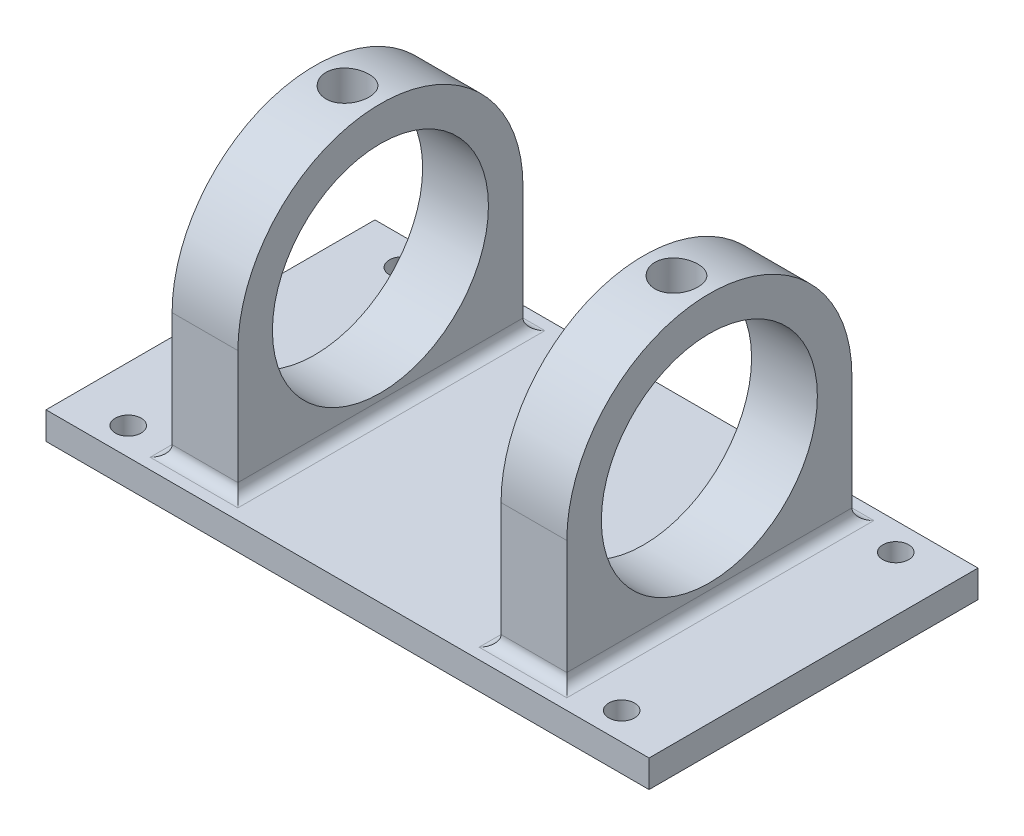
ISO-10303-21;
HEADER;
FILE_DESCRIPTION(('STEP AP214'),'2;1');
FILE_NAME('part.step','',(''),(''),'','','');
FILE_SCHEMA(('AUTOMOTIVE_DESIGN { 1 0 10303 214 1 1 1 1 }'));
ENDSEC;
DATA;
#1=APPLICATION_CONTEXT('core data for automotive mechanical design processes');
#2=APPLICATION_PROTOCOL_DEFINITION('international standard','automotive_design',2000,#1);
#3=PRODUCT_CONTEXT('',#1,'mechanical');
#4=PRODUCT('Part','Part','',(#3));
#5=PRODUCT_RELATED_PRODUCT_CATEGORY('part','',(#4));
#6=PRODUCT_DEFINITION_FORMATION('','',#4);
#7=PRODUCT_DEFINITION_CONTEXT('part definition',#1,'design');
#8=PRODUCT_DEFINITION('design','',#6,#7);
#9=PRODUCT_DEFINITION_SHAPE('','',#8);
#10=(LENGTH_UNIT() NAMED_UNIT(*) SI_UNIT(.MILLI.,.METRE.));
#11=(NAMED_UNIT(*) PLANE_ANGLE_UNIT() SI_UNIT($,.RADIAN.));
#12=(NAMED_UNIT(*) SI_UNIT($,.STERADIAN.) SOLID_ANGLE_UNIT());
#13=UNCERTAINTY_MEASURE_WITH_UNIT(LENGTH_MEASURE(1.E-05),#10,'distance_accuracy_value','');
#14=(GEOMETRIC_REPRESENTATION_CONTEXT(3) GLOBAL_UNCERTAINTY_ASSIGNED_CONTEXT((#13)) GLOBAL_UNIT_ASSIGNED_CONTEXT((#10,
#11,#12)) REPRESENTATION_CONTEXT('',''));
#15=CARTESIAN_POINT('',(0.,0.,0.));
#16=DIRECTION('',(0.,0.,1.));
#17=DIRECTION('',(1.,0.,0.));
#18=AXIS2_PLACEMENT_3D('',#15,#16,#17);
#19=CARTESIAN_POINT('',(15.24,17.68348,0.));
#20=DIRECTION('',(1.,0.,0.));
#21=DIRECTION('',(0.,0.,-1.));
#22=AXIS2_PLACEMENT_3D('',#19,#20,#21);
#23=CYLINDRICAL_SURFACE('',#22,16.51);
#24=CARTESIAN_POINT('',(22.86,17.68348,0.));
#25=DIRECTION('',(1.,0.,0.));
#26=DIRECTION('',(0.,0.,-1.));
#27=AXIS2_PLACEMENT_3D('',#24,#25,#26);
#28=CIRCLE('',#27,16.51);
#29=CARTESIAN_POINT('',(22.86,17.68348,-16.51));
#30=VERTEX_POINT('',#29);
#31=CARTESIAN_POINT('',(22.86,17.68348,16.51));
#32=VERTEX_POINT('',#31);
#33=EDGE_CURVE('E177',#30,#32,#28,.T.);
#34=ORIENTED_EDGE('',*,*,#33,.F.);
#35=DIRECTION('',(1.,0.,0.));
#36=VECTOR('',#35,1.);
#37=CARTESIAN_POINT('',(15.24,17.68348,-16.51));
#38=LINE('',#37,#36);
#39=CARTESIAN_POINT('',(15.24,17.68348,-16.51));
#40=VERTEX_POINT('',#39);
#41=EDGE_CURVE('E164',#40,#30,#38,.T.);
#42=ORIENTED_EDGE('',*,*,#41,.F.);
#43=CARTESIAN_POINT('',(15.24,17.68348,0.));
#44=DIRECTION('',(1.,0.,0.));
#45=DIRECTION('',(0.,0.,-1.));
#46=AXIS2_PLACEMENT_3D('',#43,#44,#45);
#47=CIRCLE('',#46,16.51);
#48=CARTESIAN_POINT('',(15.24,17.68348,16.51));
#49=VERTEX_POINT('',#48);
#50=EDGE_CURVE('E170',#40,#49,#47,.T.);
#51=ORIENTED_EDGE('',*,*,#50,.T.);
#52=DIRECTION('',(1.,0.,0.));
#53=VECTOR('',#52,1.);
#54=CARTESIAN_POINT('',(15.24,17.68348,16.51));
#55=LINE('',#54,#53);
#56=EDGE_CURVE('E179',#49,#32,#55,.T.);
#57=ORIENTED_EDGE('',*,*,#56,.T.);
#58=EDGE_LOOP('',(#34,#42,#51,#57));
#59=FACE_BOUND('',#58,.T.);
#60=CARTESIAN_POINT('',(19.05,34.0046319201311,2.49));
#61=CARTESIAN_POINT('',(18.9109916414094,34.0046342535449,2.48999426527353));
#62=CARTESIAN_POINT('',(18.7719028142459,34.0064270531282,2.47832007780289));
#63=CARTESIAN_POINT('',(18.4976145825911,34.0133996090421,2.43194454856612));
#64=CARTESIAN_POINT('',(18.3624190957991,34.018582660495,2.39722080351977));
#65=CARTESIAN_POINT('',(18.0999274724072,34.031735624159,2.30580920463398));
#66=CARTESIAN_POINT('',(17.9726253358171,34.039703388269,2.24913827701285));
#67=CARTESIAN_POINT('',(17.729354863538,34.0575254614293,2.11548095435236));
#68=CARTESIAN_POINT('',(17.6133849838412,34.0673795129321,2.03849733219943));
#69=CARTESIAN_POINT('',(17.395114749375,34.0879530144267,1.86573461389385));
#70=CARTESIAN_POINT('',(17.2929193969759,34.0986782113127,1.76982352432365));
#71=CARTESIAN_POINT('',(17.1060091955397,34.1197342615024,1.56221345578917));
#72=CARTESIAN_POINT('',(17.0212953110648,34.1300650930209,1.45051360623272));
#73=CARTESIAN_POINT('',(16.8713650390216,34.1492285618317,1.21382374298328));
#74=CARTESIAN_POINT('',(16.8062453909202,34.1580536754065,1.08877178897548));
#75=CARTESIAN_POINT('',(16.6979729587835,34.1731476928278,0.829349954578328));
#76=CARTESIAN_POINT('',(16.6548190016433,34.179416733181,0.694980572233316));
#77=CARTESIAN_POINT('',(16.5920213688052,34.1886517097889,0.42181965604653));
#78=CARTESIAN_POINT('',(16.5722018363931,34.1916423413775,0.283069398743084));
#79=CARTESIAN_POINT('',(16.5560895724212,34.1940681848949,0.00418255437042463));
#80=CARTESIAN_POINT('',(16.5597955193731,34.1935035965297,-0.135953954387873));
#81=CARTESIAN_POINT('',(16.5904903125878,34.1889023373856,-0.412435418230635));
#82=CARTESIAN_POINT('',(16.6172899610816,34.1848938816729,-0.548801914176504));
#83=CARTESIAN_POINT('',(16.6931143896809,34.1738867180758,-0.815079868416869));
#84=CARTESIAN_POINT('',(16.7421397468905,34.1668879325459,-0.944991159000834));
#85=CARTESIAN_POINT('',(16.8612173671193,34.1506380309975,-1.19524318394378));
#86=CARTESIAN_POINT('',(16.9313491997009,34.1413784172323,-1.31554548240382));
#87=CARTESIAN_POINT('',(17.0905908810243,34.1216386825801,-1.54274549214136));
#88=CARTESIAN_POINT('',(17.1797019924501,34.1111584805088,-1.64964231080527));
#89=CARTESIAN_POINT('',(17.3754264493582,34.0900232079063,-1.84811232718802));
#90=CARTESIAN_POINT('',(17.4822049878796,34.0793674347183,-1.9395226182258));
#91=CARTESIAN_POINT('',(17.7096722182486,34.0591835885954,-2.10315246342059));
#92=CARTESIAN_POINT('',(17.8303609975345,34.0496555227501,-2.17537189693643));
#93=CARTESIAN_POINT('',(18.082393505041,34.0328060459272,-2.29859246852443));
#94=CARTESIAN_POINT('',(18.2137456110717,34.0254863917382,-2.34957672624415));
#95=CARTESIAN_POINT('',(18.4832834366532,34.0139134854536,-2.428715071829));
#96=CARTESIAN_POINT('',(18.6214686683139,34.0096600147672,-2.45687078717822));
#97=CARTESIAN_POINT('',(18.8993003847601,34.0047425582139,-2.4893291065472));
#98=CARTESIAN_POINT('',(19.0389192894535,34.0040438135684,-2.49386270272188));
#99=CARTESIAN_POINT('',(19.3169229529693,34.006222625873,-2.47956114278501));
#100=CARTESIAN_POINT('',(19.4553077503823,34.0091000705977,-2.46072671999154));
#101=CARTESIAN_POINT('',(19.7261984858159,34.0180751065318,-2.40041972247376));
#102=CARTESIAN_POINT('',(19.8587306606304,34.0241563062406,-2.35906234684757));
#103=CARTESIAN_POINT('',(20.114981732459,34.0388401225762,-2.25500330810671));
#104=CARTESIAN_POINT('',(20.238700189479,34.0474428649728,-2.19230058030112));
#105=CARTESIAN_POINT('',(20.4748470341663,34.0662822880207,-2.0467762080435));
#106=CARTESIAN_POINT('',(20.5871823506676,34.0765309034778,-1.96380510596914));
#107=CARTESIAN_POINT('',(20.7964171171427,34.0974714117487,-1.78030687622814));
#108=CARTESIAN_POINT('',(20.8933156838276,34.1081633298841,-1.67977874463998));
#109=CARTESIAN_POINT('',(21.069756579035,34.1288944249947,-1.46300251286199));
#110=CARTESIAN_POINT('',(21.1491457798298,34.1389273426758,-1.34662909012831));
#111=CARTESIAN_POINT('',(21.2872472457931,34.1571125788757,-1.1020635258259));
#112=CARTESIAN_POINT('',(21.3459600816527,34.1652649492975,-0.973871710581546));
#113=CARTESIAN_POINT('',(21.4407978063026,34.1787431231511,-0.709785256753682));
#114=CARTESIAN_POINT('',(21.4770062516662,34.1840793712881,-0.573921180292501));
#115=CARTESIAN_POINT('',(21.526077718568,34.1913679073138,-0.29795471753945));
#116=CARTESIAN_POINT('',(21.5389422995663,34.1933204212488,-0.157852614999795));
#117=CARTESIAN_POINT('',(21.5409224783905,34.1936191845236,0.121128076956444));
#118=CARTESIAN_POINT('',(21.5302723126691,34.1920010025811,0.260005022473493));
#119=CARTESIAN_POINT('',(21.486027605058,34.1854119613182,0.533969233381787));
#120=CARTESIAN_POINT('',(21.4524331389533,34.1804411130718,0.66905651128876));
#121=CARTESIAN_POINT('',(21.3633368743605,34.1677027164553,0.931541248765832));
#122=CARTESIAN_POINT('',(21.3078514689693,34.1599372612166,1.05894438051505));
#123=CARTESIAN_POINT('',(21.1765733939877,34.1424623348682,1.30266918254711));
#124=CARTESIAN_POINT('',(21.1007800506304,34.1327527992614,1.41899048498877));
#125=CARTESIAN_POINT('',(20.930191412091,34.1123539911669,1.63843736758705));
#126=CARTESIAN_POINT('',(20.835223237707,34.101656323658,1.7414277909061));
#127=CARTESIAN_POINT('',(20.629344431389,34.0805488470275,1.93009565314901));
#128=CARTESIAN_POINT('',(20.5184300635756,34.0701391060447,2.01576902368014));
#129=CARTESIAN_POINT('',(20.2830655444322,34.0507226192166,2.16780865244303));
#130=CARTESIAN_POINT('',(20.1585420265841,34.041724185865,2.23406238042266));
#131=CARTESIAN_POINT('',(19.9000570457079,34.0262466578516,2.34461534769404));
#132=CARTESIAN_POINT('',(19.7661055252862,34.0197649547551,2.3889373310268));
#133=CARTESIAN_POINT('',(19.5346301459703,34.0115494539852,2.44433017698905));
#134=CARTESIAN_POINT('',(19.4385346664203,34.0089691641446,2.4614300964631));
#135=CARTESIAN_POINT('',(19.2449726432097,34.0055095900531,2.48426694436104));
#136=CARTESIAN_POINT('',(19.1475061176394,34.0046302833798,2.49000402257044));
#137=CARTESIAN_POINT('',(19.05,34.0046319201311,2.49));
#138=B_SPLINE_CURVE_WITH_KNOTS('',3,(#60,#61,#62,#63,#64,#65,#66,#67,#68,#69,#70,#71,#72,#73,
#74,#75,#76,#77,#78,#79,#80,#81,#82,#83,#84,#85,#86,#87,#88,#89,#90,#91,#92,#93,#94,#95,#96,#97,
#98,#99,#100,#101,#102,#103,#104,#105,#106,#107,#108,#109,#110,#111,#112,#113,#114,#115,#116,
#117,#118,#119,#120,#121,#122,#123,#124,#125,#126,#127,#128,#129,#130,#131,#132,#133,#134,#135,
#136,#137),.UNSPECIFIED.,.T.,.F.,(4,2,2,2,2,2,2,2,2,2,2,2,2,2,2,2,2,2,2,2,2,2,2,2,2,2,2,2,2,2,2,
2,2,2,2,2,2,2,4),(0.,0.416668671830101,0.833742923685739,1.2504961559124,1.66719252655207,
2.08690458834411,2.50663980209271,2.92841453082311,3.35016673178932,3.76871968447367,
4.18724912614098,4.60238196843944,5.0175255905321,5.43425430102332,5.85101074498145,
6.27191041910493,6.69281273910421,7.11404900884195,7.5352552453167,7.9523348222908,
8.36940131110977,8.78435437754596,9.19932814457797,9.61745951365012,10.0356147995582,
10.4572935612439,10.8789606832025,11.299052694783,11.7191166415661,12.1350151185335,
12.5509122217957,12.966498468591,13.3820985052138,13.8016278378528,14.2212556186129,
14.6432689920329,15.0648437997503,15.3571160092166,15.6493843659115),.UNSPECIFIED.);
#139=CARTESIAN_POINT('',(19.05,34.0046319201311,2.49));
#140=VERTEX_POINT('',#139);
#141=EDGE_CURVE('E252',#140,#140,#138,.T.);
#142=ORIENTED_EDGE('',*,*,#141,.T.);
#143=EDGE_LOOP('',(#142));
#144=FACE_BOUND('',#143,.T.);
#145=ADVANCED_FACE('F45',(#59,#144),#23,.T.);
#146=CARTESIAN_POINT('',(15.24,17.68348,0.));
#147=DIRECTION('',(1.,0.,0.));
#148=DIRECTION('',(0.,0.,-1.));
#149=AXIS2_PLACEMENT_3D('',#146,#147,#148);
#150=CYLINDRICAL_SURFACE('',#149,12.5095);
#151=CARTESIAN_POINT('',(15.24,17.68348,0.));
#152=DIRECTION('',(1.,0.,0.));
#153=DIRECTION('',(0.,0.,-1.));
#154=AXIS2_PLACEMENT_3D('',#151,#152,#153);
#155=CIRCLE('',#154,12.5095);
#156=CARTESIAN_POINT('',(15.24,17.68348,-12.5095));
#157=VERTEX_POINT('',#156);
#158=EDGE_CURVE('E193',#157,#157,#155,.T.);
#159=ORIENTED_EDGE('',*,*,#158,.F.);
#160=EDGE_LOOP('',(#159));
#161=FACE_BOUND('',#160,.T.);
#162=CARTESIAN_POINT('',(22.86,17.68348,0.));
#163=DIRECTION('',(1.,0.,0.));
#164=DIRECTION('',(0.,0.,-1.));
#165=AXIS2_PLACEMENT_3D('',#162,#163,#164);
#166=CIRCLE('',#165,12.5095);
#167=CARTESIAN_POINT('',(22.86,17.68348,-12.5095));
#168=VERTEX_POINT('',#167);
#169=EDGE_CURVE('E188',#168,#168,#166,.T.);
#170=ORIENTED_EDGE('',*,*,#169,.T.);
#171=EDGE_LOOP('',(#170));
#172=FACE_BOUND('',#171,.T.);
#173=CARTESIAN_POINT('',(19.05,29.9426598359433,2.49));
#174=CARTESIAN_POINT('',(18.9116303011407,29.9426625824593,2.48999486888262));
#175=CARTESIAN_POINT('',(18.7731958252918,29.9450279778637,2.47842699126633));
#176=CARTESIAN_POINT('',(18.5002421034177,29.9542202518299,2.43249911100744));
#177=CARTESIAN_POINT('',(18.3657260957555,29.9610507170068,2.39812078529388));
#178=CARTESIAN_POINT('',(18.1045977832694,29.9783695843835,2.30767944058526));
#179=CARTESIAN_POINT('',(17.9779777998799,29.9888543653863,2.25163788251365));
#180=CARTESIAN_POINT('',(17.7359410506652,30.0122961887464,2.11951948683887));
#181=CARTESIAN_POINT('',(17.620523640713,30.0252530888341,2.04344380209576));
#182=CARTESIAN_POINT('',(17.4025452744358,30.0523820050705,1.87228065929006));
#183=CARTESIAN_POINT('',(17.3001640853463,30.0665672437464,1.77696632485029));
#184=CARTESIAN_POINT('',(17.1127335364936,30.0944381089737,1.57052169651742));
#185=CARTESIAN_POINT('',(17.0276853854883,30.1081237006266,1.45939030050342));
#186=CARTESIAN_POINT('',(16.876638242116,30.1335958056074,1.22327650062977));
#187=CARTESIAN_POINT('',(16.8108099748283,30.1453649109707,1.09818284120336));
#188=CARTESIAN_POINT('',(16.7011727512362,30.1655294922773,0.838437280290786));
#189=CARTESIAN_POINT('',(16.6573617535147,30.1739252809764,0.703786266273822));
#190=CARTESIAN_POINT('',(16.5935620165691,30.1863038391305,0.430613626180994));
#191=CARTESIAN_POINT('',(16.5732697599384,30.1903427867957,0.292165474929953));
#192=CARTESIAN_POINT('',(16.5561366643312,30.1937465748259,0.0137748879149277));
#193=CARTESIAN_POINT('',(16.559293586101,30.193111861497,-0.126167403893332));
#194=CARTESIAN_POINT('',(16.5887388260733,30.1872834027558,-0.401488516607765));
#195=CARTESIAN_POINT('',(16.6147002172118,30.1821540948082,-0.536903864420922));
#196=CARTESIAN_POINT('',(16.6884990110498,30.1679854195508,-0.801416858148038));
#197=CARTESIAN_POINT('',(16.736337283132,30.1589458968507,-0.930514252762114));
#198=CARTESIAN_POINT('',(16.8528354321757,30.137866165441,-1.17966061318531));
#199=CARTESIAN_POINT('',(16.9216235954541,30.1258075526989,-1.2996479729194));
#200=CARTESIAN_POINT('',(17.0779739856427,30.1000192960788,-1.52649781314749));
#201=CARTESIAN_POINT('',(17.1655383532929,30.0862894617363,-1.63335879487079));
#202=CARTESIAN_POINT('',(17.3587496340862,30.0583959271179,-1.83286237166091));
#203=CARTESIAN_POINT('',(17.4646826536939,30.0442288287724,-1.92522761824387));
#204=CARTESIAN_POINT('',(17.6906775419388,30.0172824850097,-2.0909268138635));
#205=CARTESIAN_POINT('',(17.810739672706,30.0045032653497,-2.16426040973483));
#206=CARTESIAN_POINT('',(18.0619805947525,29.9817730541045,-2.28990899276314));
#207=CARTESIAN_POINT('',(18.1931822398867,29.9718280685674,-2.34217944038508));
#208=CARTESIAN_POINT('',(18.4627493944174,29.9559807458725,-2.42385313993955));
#209=CARTESIAN_POINT('',(18.6011139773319,29.9500778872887,-2.45325934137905));
#210=CARTESIAN_POINT('',(18.8785666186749,29.9430875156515,-2.48795604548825));
#211=CARTESIAN_POINT('',(19.0176026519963,29.9419200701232,-2.49364690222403));
#212=CARTESIAN_POINT('',(19.2946374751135,29.9443182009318,-2.48182836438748));
#213=CARTESIAN_POINT('',(19.4326363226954,29.9478835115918,-2.46432027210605));
#214=CARTESIAN_POINT('',(19.7023361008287,29.9592706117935,-2.40694586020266));
#215=CARTESIAN_POINT('',(19.8340843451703,29.9670517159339,-2.36729314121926));
#216=CARTESIAN_POINT('',(20.0890672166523,29.9859580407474,-2.26698332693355));
#217=CARTESIAN_POINT('',(20.212301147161,29.9970835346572,-2.20632451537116));
#218=CARTESIAN_POINT('',(20.4485100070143,30.0216048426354,-2.06481694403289));
#219=CARTESIAN_POINT('',(20.5613318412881,30.0350281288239,-1.98371748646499));
#220=CARTESIAN_POINT('',(20.7719110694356,30.06255702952,-1.80396521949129));
#221=CARTESIAN_POINT('',(20.8696669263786,30.0766627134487,-1.70531062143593));
#222=CARTESIAN_POINT('',(21.0488554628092,30.1042262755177,-1.4914519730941));
#223=CARTESIAN_POINT('',(21.1300175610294,30.1176710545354,-1.37601924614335));
#224=CARTESIAN_POINT('',(21.2717962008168,30.1421707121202,-1.13292442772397));
#225=CARTESIAN_POINT('',(21.3324135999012,30.1532256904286,-1.00526284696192));
#226=CARTESIAN_POINT('',(21.4309869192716,30.1716441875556,-0.742048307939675));
#227=CARTESIAN_POINT('',(21.4690705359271,30.1790284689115,-0.606544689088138));
#228=CARTESIAN_POINT('',(21.5219000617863,30.1893625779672,-0.330902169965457));
#229=CARTESIAN_POINT('',(21.5366487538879,30.1923129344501,-0.190763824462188));
#230=CARTESIAN_POINT('',(21.5422828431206,30.1934344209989,0.08758481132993));
#231=CARTESIAN_POINT('',(21.5335751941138,30.1916870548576,0.225786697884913));
#232=CARTESIAN_POINT('',(21.493441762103,30.1837806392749,0.498715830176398));
#233=CARTESIAN_POINT('',(21.4620162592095,30.177621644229,0.633443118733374));
#234=CARTESIAN_POINT('',(21.3775193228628,30.1615861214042,0.895348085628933));
#235=CARTESIAN_POINT('',(21.3244963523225,30.1517179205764,1.02254194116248));
#236=CARTESIAN_POINT('',(21.1983608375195,30.129326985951,1.26628620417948));
#237=CARTESIAN_POINT('',(21.1252467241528,30.1168040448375,1.3828357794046));
#238=CARTESIAN_POINT('',(20.9596294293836,30.0902283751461,1.60399646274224));
#239=CARTESIAN_POINT('',(20.866834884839,30.0761543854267,1.70838685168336));
#240=CARTESIAN_POINT('',(20.6650899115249,30.048189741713,1.9002544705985));
#241=CARTESIAN_POINT('',(20.5561356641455,30.0342991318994,1.98772769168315));
#242=CARTESIAN_POINT('',(20.3237723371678,30.0081111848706,2.14416216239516));
#243=CARTESIAN_POINT('',(20.2002216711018,29.9958323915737,2.21291633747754));
#244=CARTESIAN_POINT('',(19.9431120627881,29.9744845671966,2.3285798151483));
#245=CARTESIAN_POINT('',(19.8095623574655,29.9654126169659,2.37550899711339));
#246=CARTESIAN_POINT('',(19.5714193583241,29.9533228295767,2.4370560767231));
#247=CARTESIAN_POINT('',(19.4681871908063,29.9493489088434,2.45687463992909));
#248=CARTESIAN_POINT('',(19.2599824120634,29.9440164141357,2.48334832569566));
#249=CARTESIAN_POINT('',(19.1550098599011,29.9426577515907,2.49000389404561));
#250=CARTESIAN_POINT('',(19.05,29.9426598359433,2.49));
#251=B_SPLINE_CURVE_WITH_KNOTS('',3,(#173,#174,#175,#176,#177,#178,#179,#180,#181,#182,#183,
#184,#185,#186,#187,#188,#189,#190,#191,#192,#193,#194,#195,#196,#197,#198,#199,#200,#201,#202,
#203,#204,#205,#206,#207,#208,#209,#210,#211,#212,#213,#214,#215,#216,#217,#218,#219,#220,#221,
#222,#223,#224,#225,#226,#227,#228,#229,#230,#231,#232,#233,#234,#235,#236,#237,#238,#239,#240,
#241,#242,#243,#244,#245,#246,#247,#248,#249,#250),.UNSPECIFIED.,.T.,.F.,(4,2,2,2,2,2,2,2,2,2,2,
2,2,2,2,2,2,2,2,2,2,2,2,2,2,2,2,2,2,2,2,2,2,2,2,2,2,2,4),(0.,0.414724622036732,
0.829782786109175,1.24443081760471,1.65905499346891,2.0788890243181,2.49875232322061,
2.92223897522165,3.3456863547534,3.76360591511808,4.18148556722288,4.59347047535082,
5.00547175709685,5.42004845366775,5.83467244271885,6.25645525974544,6.67824590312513,
7.10092383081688,7.52354722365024,7.93900639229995,8.35444223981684,8.76593845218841,
9.17746829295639,9.59431441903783,10.0112030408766,10.43442585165,10.8576309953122,
11.278414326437,11.6991474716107,12.1126283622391,12.5261041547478,12.9386572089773,
13.3512424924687,13.7704256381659,14.1897079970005,14.6134557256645,15.0368167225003,
15.351565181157,15.6663029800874),.UNSPECIFIED.);
#252=CARTESIAN_POINT('',(19.05,29.9426598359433,2.49));
#253=VERTEX_POINT('',#252);
#254=EDGE_CURVE('E49',#253,#253,#251,.T.);
#255=ORIENTED_EDGE('',*,*,#254,.F.);
#256=EDGE_LOOP('',(#255));
#257=FACE_BOUND('',#256,.T.);
#258=ADVANCED_FACE('F283',(#161,#172,#257),#150,.F.);
#259=CARTESIAN_POINT('',(0.,3.175,0.));
#260=DIRECTION('',(0.,-1.,0.));
#261=DIRECTION('',(0.,0.,-1.));
#262=AXIS2_PLACEMENT_3D('',#259,#260,#261);
#263=PLANE('',#262);
#264=CARTESIAN_POINT('',(28.575,3.175,-15.875));
#265=DIRECTION('',(0.,1.,0.));
#266=DIRECTION('',(0.,0.,1.));
#267=AXIS2_PLACEMENT_3D('',#264,#265,#266);
#268=CIRCLE('',#267,1.49999999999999);
#269=CARTESIAN_POINT('',(28.575,3.175,-14.375));
#270=VERTEX_POINT('',#269);
#271=EDGE_CURVE('E705',#270,#270,#268,.T.);
#272=ORIENTED_EDGE('',*,*,#271,.F.);
#273=EDGE_LOOP('',(#272));
#274=FACE_BOUND('',#273,.T.);
#275=CARTESIAN_POINT('',(-28.575,3.175,15.875));
#276=DIRECTION('',(0.,1.,0.));
#277=DIRECTION('',(0.,0.,1.));
#278=AXIS2_PLACEMENT_3D('',#275,#276,#277);
#279=CIRCLE('',#278,1.49999999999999);
#280=CARTESIAN_POINT('',(-28.575,3.175,17.375));
#281=VERTEX_POINT('',#280);
#282=EDGE_CURVE('E709',#281,#281,#279,.T.);
#283=ORIENTED_EDGE('',*,*,#282,.F.);
#284=EDGE_LOOP('',(#283));
#285=FACE_BOUND('',#284,.T.);
#286=CARTESIAN_POINT('',(-28.575,3.175,-15.875));
#287=DIRECTION('',(0.,1.,0.));
#288=DIRECTION('',(0.,0.,1.));
#289=AXIS2_PLACEMENT_3D('',#286,#287,#288);
#290=CIRCLE('',#289,1.49999999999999);
#291=CARTESIAN_POINT('',(-28.575,3.175,-14.375));
#292=VERTEX_POINT('',#291);
#293=EDGE_CURVE('E713',#292,#292,#290,.T.);
#294=ORIENTED_EDGE('',*,*,#293,.F.);
#295=EDGE_LOOP('',(#294));
#296=FACE_BOUND('',#295,.T.);
#297=CARTESIAN_POINT('',(28.575,3.175,15.875));
#298=DIRECTION('',(0.,1.,0.));
#299=DIRECTION('',(0.,0.,1.));
#300=AXIS2_PLACEMENT_3D('',#297,#298,#299);
#301=CIRCLE('',#300,1.49999999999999);
#302=CARTESIAN_POINT('',(28.575,3.175,17.375));
#303=VERTEX_POINT('',#302);
#304=EDGE_CURVE('E716',#303,#303,#301,.T.);
#305=ORIENTED_EDGE('',*,*,#304,.F.);
#306=EDGE_LOOP('',(#305));
#307=FACE_BOUND('',#306,.T.);
#308=DIRECTION('',(0.,0.,-1.));
#309=VECTOR('',#308,1.);
#310=CARTESIAN_POINT('',(24.13,3.175,16.51));
#311=LINE('',#310,#309);
#312=CARTESIAN_POINT('',(24.13,3.175,-17.78));
#313=VERTEX_POINT('',#312);
#314=CARTESIAN_POINT('',(24.13,3.175,17.78));
#315=VERTEX_POINT('',#314);
#316=EDGE_CURVE('E236',#313,#315,#311,.F.);
#317=ORIENTED_EDGE('',*,*,#316,.T.);
#318=DIRECTION('',(1.,0.,0.));
#319=VECTOR('',#318,1.);
#320=CARTESIAN_POINT('',(0.,3.175,17.78));
#321=LINE('',#320,#319);
#322=CARTESIAN_POINT('',(13.97,3.175,17.78));
#323=VERTEX_POINT('',#322);
#324=EDGE_CURVE('E243',#315,#323,#321,.F.);
#325=ORIENTED_EDGE('',*,*,#324,.T.);
#326=DIRECTION('',(0.,0.,-1.));
#327=VECTOR('',#326,1.);
#328=CARTESIAN_POINT('',(13.97,3.175,0.));
#329=LINE('',#328,#327);
#330=CARTESIAN_POINT('',(13.97,3.175,-17.78));
#331=VERTEX_POINT('',#330);
#332=EDGE_CURVE('E241',#323,#331,#329,.T.);
#333=ORIENTED_EDGE('',*,*,#332,.T.);
#334=DIRECTION('',(1.,0.,0.));
#335=VECTOR('',#334,1.);
#336=CARTESIAN_POINT('',(0.,3.175,-17.78));
#337=LINE('',#336,#335);
#338=EDGE_CURVE('E239',#331,#313,#337,.T.);
#339=ORIENTED_EDGE('',*,*,#338,.T.);
#340=EDGE_LOOP('',(#317,#325,#333,#339));
#341=FACE_BOUND('',#340,.T.);
#342=DIRECTION('',(0.,0.,-1.));
#343=VECTOR('',#342,1.);
#344=CARTESIAN_POINT('',(-13.97,3.175,0.));
#345=LINE('',#344,#343);
#346=CARTESIAN_POINT('',(-13.97,3.175,-17.78));
#347=VERTEX_POINT('',#346);
#348=CARTESIAN_POINT('',(-13.97,3.175,17.78));
#349=VERTEX_POINT('',#348);
#350=EDGE_CURVE('E609',#347,#349,#345,.F.);
#351=ORIENTED_EDGE('',*,*,#350,.T.);
#352=DIRECTION('',(-1.,0.,0.));
#353=VECTOR('',#352,1.);
#354=CARTESIAN_POINT('',(-22.86,3.175,17.78));
#355=LINE('',#354,#353);
#356=CARTESIAN_POINT('',(-24.13,3.175,17.78));
#357=VERTEX_POINT('',#356);
#358=EDGE_CURVE('E611',#349,#357,#355,.T.);
#359=ORIENTED_EDGE('',*,*,#358,.T.);
#360=DIRECTION('',(0.,0.,-1.));
#361=VECTOR('',#360,1.);
#362=CARTESIAN_POINT('',(-24.13,3.175,-16.51));
#363=LINE('',#362,#361);
#364=CARTESIAN_POINT('',(-24.13,3.175,-17.78));
#365=VERTEX_POINT('',#364);
#366=EDGE_CURVE('E605',#357,#365,#363,.T.);
#367=ORIENTED_EDGE('',*,*,#366,.T.);
#368=DIRECTION('',(-1.,0.,0.));
#369=VECTOR('',#368,1.);
#370=CARTESIAN_POINT('',(-15.24,3.175,-17.78));
#371=LINE('',#370,#369);
#372=EDGE_CURVE('E607',#365,#347,#371,.F.);
#373=ORIENTED_EDGE('',*,*,#372,.T.);
#374=EDGE_LOOP('',(#351,#359,#367,#373));
#375=FACE_BOUND('',#374,.T.);
#376=DIRECTION('',(0.,0.,-1.));
#377=VECTOR('',#376,1.);
#378=CARTESIAN_POINT('',(34.925,3.175,19.05));
#379=LINE('',#378,#377);
#380=CARTESIAN_POINT('',(34.925,3.175,19.05));
#381=VERTEX_POINT('',#380);
#382=CARTESIAN_POINT('',(34.925,3.175,-19.05));
#383=VERTEX_POINT('',#382);
#384=EDGE_CURVE('E596',#381,#383,#379,.T.);
#385=ORIENTED_EDGE('',*,*,#384,.T.);
#386=DIRECTION('',(-1.,0.,0.));
#387=VECTOR('',#386,1.);
#388=CARTESIAN_POINT('',(-34.925,3.175,-19.05));
#389=LINE('',#388,#387);
#390=CARTESIAN_POINT('',(-34.925,3.175,-19.05));
#391=VERTEX_POINT('',#390);
#392=EDGE_CURVE('E659',#383,#391,#389,.T.);
#393=ORIENTED_EDGE('',*,*,#392,.T.);
#394=DIRECTION('',(0.,0.,1.));
#395=VECTOR('',#394,1.);
#396=CARTESIAN_POINT('',(-34.925,3.175,19.05));
#397=LINE('',#396,#395);
#398=CARTESIAN_POINT('',(-34.925,3.175,19.05));
#399=VERTEX_POINT('',#398);
#400=EDGE_CURVE('E660',#391,#399,#397,.T.);
#401=ORIENTED_EDGE('',*,*,#400,.T.);
#402=DIRECTION('',(1.,0.,0.));
#403=VECTOR('',#402,1.);
#404=CARTESIAN_POINT('',(-34.925,3.175,19.05));
#405=LINE('',#404,#403);
#406=EDGE_CURVE('E590',#399,#381,#405,.T.);
#407=ORIENTED_EDGE('',*,*,#406,.T.);
#408=EDGE_LOOP('',(#385,#393,#401,#407));
#409=FACE_BOUND('',#408,.T.);
#410=ADVANCED_FACE('F288',(#274,#285,#296,#307,#341,#375,#409),#263,.F.);
#411=CARTESIAN_POINT('',(34.925,3.175,19.05));
#412=DIRECTION('',(-1.,0.,0.));
#413=DIRECTION('',(0.,0.,1.));
#414=AXIS2_PLACEMENT_3D('',#411,#412,#413);
#415=PLANE('',#414);
#416=DIRECTION('',(0.,0.,-1.));
#417=VECTOR('',#416,1.);
#418=CARTESIAN_POINT('',(34.925,0.,19.05));
#419=LINE('',#418,#417);
#420=CARTESIAN_POINT('',(34.925,0.,19.05));
#421=VERTEX_POINT('',#420);
#422=CARTESIAN_POINT('',(34.925,0.,-19.05));
#423=VERTEX_POINT('',#422);
#424=EDGE_CURVE('E573',#421,#423,#419,.T.);
#425=ORIENTED_EDGE('',*,*,#424,.T.);
#426=DIRECTION('',(0.,-1.,0.));
#427=VECTOR('',#426,1.);
#428=CARTESIAN_POINT('',(34.925,3.175,-19.05));
#429=LINE('',#428,#427);
#430=EDGE_CURVE('E576',#383,#423,#429,.T.);
#431=ORIENTED_EDGE('',*,*,#430,.F.);
#432=ORIENTED_EDGE('',*,*,#384,.F.);
#433=DIRECTION('',(0.,-1.,0.));
#434=VECTOR('',#433,1.);
#435=CARTESIAN_POINT('',(34.925,3.175,19.05));
#436=LINE('',#435,#434);
#437=EDGE_CURVE('E578',#381,#421,#436,.T.);
#438=ORIENTED_EDGE('',*,*,#437,.T.);
#439=EDGE_LOOP('',(#425,#431,#432,#438));
#440=FACE_BOUND('',#439,.T.);
#441=ADVANCED_FACE('F382',(#440),#415,.F.);
#442=CARTESIAN_POINT('',(-34.925,3.175,-19.05));
#443=DIRECTION('',(0.,0.,1.));
#444=DIRECTION('',(1.,0.,0.));
#445=AXIS2_PLACEMENT_3D('',#442,#443,#444);
#446=PLANE('',#445);
#447=DIRECTION('',(-1.,0.,0.));
#448=VECTOR('',#447,1.);
#449=CARTESIAN_POINT('',(-34.925,0.,-19.05));
#450=LINE('',#449,#448);
#451=CARTESIAN_POINT('',(-34.925,0.,-19.05));
#452=VERTEX_POINT('',#451);
#453=EDGE_CURVE('E581',#423,#452,#450,.T.);
#454=ORIENTED_EDGE('',*,*,#453,.T.);
#455=DIRECTION('',(0.,-1.,0.));
#456=VECTOR('',#455,1.);
#457=CARTESIAN_POINT('',(-34.925,3.175,-19.05));
#458=LINE('',#457,#456);
#459=EDGE_CURVE('E601',#391,#452,#458,.T.);
#460=ORIENTED_EDGE('',*,*,#459,.F.);
#461=ORIENTED_EDGE('',*,*,#392,.F.);
#462=ORIENTED_EDGE('',*,*,#430,.T.);
#463=EDGE_LOOP('',(#454,#460,#461,#462));
#464=FACE_BOUND('',#463,.T.);
#465=ADVANCED_FACE('F543',(#464),#446,.F.);
#466=CARTESIAN_POINT('',(-34.925,3.175,19.05));
#467=DIRECTION('',(1.,0.,0.));
#468=DIRECTION('',(0.,0.,-1.));
#469=AXIS2_PLACEMENT_3D('',#466,#467,#468);
#470=PLANE('',#469);
#471=DIRECTION('',(0.,0.,1.));
#472=VECTOR('',#471,1.);
#473=CARTESIAN_POINT('',(-34.925,0.,19.05));
#474=LINE('',#473,#472);
#475=CARTESIAN_POINT('',(-34.925,0.,19.05));
#476=VERTEX_POINT('',#475);
#477=EDGE_CURVE('E584',#452,#476,#474,.T.);
#478=ORIENTED_EDGE('',*,*,#477,.T.);
#479=DIRECTION('',(0.,-1.,0.));
#480=VECTOR('',#479,1.);
#481=CARTESIAN_POINT('',(-34.925,3.175,19.05));
#482=LINE('',#481,#480);
#483=EDGE_CURVE('E598',#399,#476,#482,.T.);
#484=ORIENTED_EDGE('',*,*,#483,.F.);
#485=ORIENTED_EDGE('',*,*,#400,.F.);
#486=ORIENTED_EDGE('',*,*,#459,.T.);
#487=EDGE_LOOP('',(#478,#484,#485,#486));
#488=FACE_BOUND('',#487,.T.);
#489=ADVANCED_FACE('F534',(#488),#470,.F.);
#490=CARTESIAN_POINT('',(-34.925,3.175,19.05));
#491=DIRECTION('',(0.,0.,-1.));
#492=DIRECTION('',(-1.,0.,0.));
#493=AXIS2_PLACEMENT_3D('',#490,#491,#492);
#494=PLANE('',#493);
#495=DIRECTION('',(1.,0.,0.));
#496=VECTOR('',#495,1.);
#497=CARTESIAN_POINT('',(-34.925,0.,19.05));
#498=LINE('',#497,#496);
#499=EDGE_CURVE('E594',#476,#421,#498,.T.);
#500=ORIENTED_EDGE('',*,*,#499,.T.);
#501=ORIENTED_EDGE('',*,*,#437,.F.);
#502=ORIENTED_EDGE('',*,*,#406,.F.);
#503=ORIENTED_EDGE('',*,*,#483,.T.);
#504=EDGE_LOOP('',(#500,#501,#502,#503));
#505=FACE_BOUND('',#504,.T.);
#506=ADVANCED_FACE('F371',(#505),#494,.F.);
#507=CARTESIAN_POINT('',(0.,0.,0.));
#508=DIRECTION('',(0.,-1.,0.));
#509=DIRECTION('',(0.,0.,-1.));
#510=AXIS2_PLACEMENT_3D('',#507,#508,#509);
#511=PLANE('',#510);
#512=CARTESIAN_POINT('',(28.575,0.,-15.875));
#513=DIRECTION('',(0.,1.,0.));
#514=DIRECTION('',(0.,0.,1.));
#515=AXIS2_PLACEMENT_3D('',#512,#513,#514);
#516=CIRCLE('',#515,1.5);
#517=CARTESIAN_POINT('',(28.575,0.,-14.375));
#518=VERTEX_POINT('',#517);
#519=EDGE_CURVE('E728',#518,#518,#516,.T.);
#520=ORIENTED_EDGE('',*,*,#519,.T.);
#521=EDGE_LOOP('',(#520));
#522=FACE_BOUND('',#521,.T.);
#523=CARTESIAN_POINT('',(-28.575,0.,15.875));
#524=DIRECTION('',(0.,1.,0.));
#525=DIRECTION('',(0.,0.,1.));
#526=AXIS2_PLACEMENT_3D('',#523,#524,#525);
#527=CIRCLE('',#526,1.5);
#528=CARTESIAN_POINT('',(-28.575,0.,17.375));
#529=VERTEX_POINT('',#528);
#530=EDGE_CURVE('E724',#529,#529,#527,.T.);
#531=ORIENTED_EDGE('',*,*,#530,.T.);
#532=EDGE_LOOP('',(#531));
#533=FACE_BOUND('',#532,.T.);
#534=CARTESIAN_POINT('',(-28.575,0.,-15.875));
#535=DIRECTION('',(0.,1.,0.));
#536=DIRECTION('',(0.,0.,1.));
#537=AXIS2_PLACEMENT_3D('',#534,#535,#536);
#538=CIRCLE('',#537,1.5);
#539=CARTESIAN_POINT('',(-28.575,0.,-14.375));
#540=VERTEX_POINT('',#539);
#541=EDGE_CURVE('E718',#540,#540,#538,.T.);
#542=ORIENTED_EDGE('',*,*,#541,.T.);
#543=EDGE_LOOP('',(#542));
#544=FACE_BOUND('',#543,.T.);
#545=CARTESIAN_POINT('',(28.575,0.,15.875));
#546=DIRECTION('',(0.,1.,0.));
#547=DIRECTION('',(0.,0.,1.));
#548=AXIS2_PLACEMENT_3D('',#545,#546,#547);
#549=CIRCLE('',#548,1.5);
#550=CARTESIAN_POINT('',(28.575,0.,17.375));
#551=VERTEX_POINT('',#550);
#552=EDGE_CURVE('E273',#551,#551,#549,.T.);
#553=ORIENTED_EDGE('',*,*,#552,.T.);
#554=EDGE_LOOP('',(#553));
#555=FACE_BOUND('',#554,.T.);
#556=ORIENTED_EDGE('',*,*,#424,.F.);
#557=ORIENTED_EDGE('',*,*,#499,.F.);
#558=ORIENTED_EDGE('',*,*,#477,.F.);
#559=ORIENTED_EDGE('',*,*,#453,.F.);
#560=EDGE_LOOP('',(#556,#557,#558,#559));
#561=FACE_BOUND('',#560,.T.);
#562=ADVANCED_FACE('F365',(#522,#533,#544,#555,#561),#511,.T.);
#563=CARTESIAN_POINT('',(-15.24,17.68348,0.));
#564=DIRECTION('',(1.,0.,0.));
#565=DIRECTION('',(0.,0.,-1.));
#566=AXIS2_PLACEMENT_3D('',#563,#564,#565);
#567=PLANE('',#566);
#568=DIRECTION('',(0.,-1.,0.));
#569=VECTOR('',#568,1.);
#570=CARTESIAN_POINT('',(-15.24,17.68348,16.51));
#571=LINE('',#570,#569);
#572=CARTESIAN_POINT('',(-15.24,17.68348,16.51));
#573=VERTEX_POINT('',#572);
#574=CARTESIAN_POINT('',(-15.24,4.445,16.51));
#575=VERTEX_POINT('',#574);
#576=EDGE_CURVE('E643',#573,#575,#571,.T.);
#577=ORIENTED_EDGE('',*,*,#576,.T.);
#578=DIRECTION('',(0.,0.,-1.));
#579=VECTOR('',#578,1.);
#580=CARTESIAN_POINT('',(-15.24,4.445,0.));
#581=LINE('',#580,#579);
#582=CARTESIAN_POINT('',(-15.24,4.445,-16.51));
#583=VERTEX_POINT('',#582);
#584=EDGE_CURVE('E617',#575,#583,#581,.T.);
#585=ORIENTED_EDGE('',*,*,#584,.T.);
#586=DIRECTION('',(0.,1.,0.));
#587=VECTOR('',#586,1.);
#588=CARTESIAN_POINT('',(-15.24,17.68348,-16.51));
#589=LINE('',#588,#587);
#590=CARTESIAN_POINT('',(-15.24,17.68348,-16.51));
#591=VERTEX_POINT('',#590);
#592=EDGE_CURVE('E647',#583,#591,#589,.T.);
#593=ORIENTED_EDGE('',*,*,#592,.T.);
#594=CARTESIAN_POINT('',(-15.24,17.68348,0.));
#595=DIRECTION('',(1.,0.,0.));
#596=DIRECTION('',(0.,0.,-1.));
#597=AXIS2_PLACEMENT_3D('',#594,#595,#596);
#598=CIRCLE('',#597,16.51);
#599=EDGE_CURVE('E640',#591,#573,#598,.T.);
#600=ORIENTED_EDGE('',*,*,#599,.T.);
#601=EDGE_LOOP('',(#577,#585,#593,#600));
#602=FACE_BOUND('',#601,.T.);
#603=CARTESIAN_POINT('',(-15.24,17.68348,0.));
#604=DIRECTION('',(1.,0.,0.));
#605=DIRECTION('',(0.,0.,-1.));
#606=AXIS2_PLACEMENT_3D('',#603,#604,#605);
#607=CIRCLE('',#606,12.5095);
#608=CARTESIAN_POINT('',(-15.24,17.68348,-12.5095));
#609=VERTEX_POINT('',#608);
#610=EDGE_CURVE('E205',#609,#609,#607,.T.);
#611=ORIENTED_EDGE('',*,*,#610,.F.);
#612=EDGE_LOOP('',(#611));
#613=FACE_BOUND('',#612,.T.);
#614=ADVANCED_FACE('F370',(#602,#613),#567,.T.);
#615=CARTESIAN_POINT('',(-22.86,17.68348,0.));
#616=DIRECTION('',(1.,0.,0.));
#617=DIRECTION('',(0.,0.,-1.));
#618=AXIS2_PLACEMENT_3D('',#615,#616,#617);
#619=PLANE('',#618);
#620=DIRECTION('',(0.,1.,0.));
#621=VECTOR('',#620,1.);
#622=CARTESIAN_POINT('',(-22.86,17.68348,-16.51));
#623=LINE('',#622,#621);
#624=CARTESIAN_POINT('',(-22.86,4.445,-16.51));
#625=VERTEX_POINT('',#624);
#626=CARTESIAN_POINT('',(-22.86,17.68348,-16.51));
#627=VERTEX_POINT('',#626);
#628=EDGE_CURVE('E644',#625,#627,#623,.T.);
#629=ORIENTED_EDGE('',*,*,#628,.F.);
#630=DIRECTION('',(0.,0.,-1.));
#631=VECTOR('',#630,1.);
#632=CARTESIAN_POINT('',(-22.86,4.445,16.51));
#633=LINE('',#632,#631);
#634=CARTESIAN_POINT('',(-22.86,4.445,16.51));
#635=VERTEX_POINT('',#634);
#636=EDGE_CURVE('E237',#625,#635,#633,.F.);
#637=ORIENTED_EDGE('',*,*,#636,.T.);
#638=DIRECTION('',(0.,-1.,0.));
#639=VECTOR('',#638,1.);
#640=CARTESIAN_POINT('',(-22.86,17.68348,16.51));
#641=LINE('',#640,#639);
#642=CARTESIAN_POINT('',(-22.86,17.68348,16.51));
#643=VERTEX_POINT('',#642);
#644=EDGE_CURVE('E651',#643,#635,#641,.T.);
#645=ORIENTED_EDGE('',*,*,#644,.F.);
#646=CARTESIAN_POINT('',(-22.86,17.68348,0.));
#647=DIRECTION('',(1.,0.,0.));
#648=DIRECTION('',(0.,0.,-1.));
#649=AXIS2_PLACEMENT_3D('',#646,#647,#648);
#650=CIRCLE('',#649,16.51);
#651=EDGE_CURVE('E638',#627,#643,#650,.T.);
#652=ORIENTED_EDGE('',*,*,#651,.F.);
#653=EDGE_LOOP('',(#629,#637,#645,#652));
#654=FACE_BOUND('',#653,.T.);
#655=CARTESIAN_POINT('',(-22.86,17.68348,0.));
#656=DIRECTION('',(1.,0.,0.));
#657=DIRECTION('',(0.,0.,-1.));
#658=AXIS2_PLACEMENT_3D('',#655,#656,#657);
#659=CIRCLE('',#658,12.5095);
#660=CARTESIAN_POINT('',(-22.86,17.68348,-12.5095));
#661=VERTEX_POINT('',#660);
#662=EDGE_CURVE('E630',#661,#661,#659,.T.);
#663=ORIENTED_EDGE('',*,*,#662,.T.);
#664=EDGE_LOOP('',(#663));
#665=FACE_BOUND('',#664,.T.);
#666=ADVANCED_FACE('F511',(#654,#665),#619,.F.);
#667=CARTESIAN_POINT('',(-15.24,17.68348,0.));
#668=DIRECTION('',(-1.,0.,0.));
#669=DIRECTION('',(0.,0.,1.));
#670=AXIS2_PLACEMENT_3D('',#667,#668,#669);
#671=CYLINDRICAL_SURFACE('',#670,16.51);
#672=CARTESIAN_POINT('',(-19.05,34.0046319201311,2.49));
#673=CARTESIAN_POINT('',(-19.1890083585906,34.0046342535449,2.48999426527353));
#674=CARTESIAN_POINT('',(-19.3280971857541,34.0064270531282,2.47832007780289));
#675=CARTESIAN_POINT('',(-19.6023854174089,34.0133996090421,2.43194454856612));
#676=CARTESIAN_POINT('',(-19.7375809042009,34.018582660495,2.39722080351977));
#677=CARTESIAN_POINT('',(-20.0000725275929,34.031735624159,2.30580920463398));
#678=CARTESIAN_POINT('',(-20.1273746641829,34.039703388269,2.24913827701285));
#679=CARTESIAN_POINT('',(-20.370645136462,34.0575254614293,2.11548095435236));
#680=CARTESIAN_POINT('',(-20.4866150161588,34.0673795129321,2.03849733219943));
#681=CARTESIAN_POINT('',(-20.704885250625,34.0879530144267,1.86573461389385));
#682=CARTESIAN_POINT('',(-20.8070806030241,34.0986782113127,1.76982352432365));
#683=CARTESIAN_POINT('',(-20.9939908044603,34.1197342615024,1.56221345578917));
#684=CARTESIAN_POINT('',(-21.0787046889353,34.1300650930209,1.45051360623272));
#685=CARTESIAN_POINT('',(-21.2286349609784,34.1492285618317,1.21382374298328));
#686=CARTESIAN_POINT('',(-21.2937546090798,34.1580536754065,1.08877178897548));
#687=CARTESIAN_POINT('',(-21.4020270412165,34.1731476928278,0.829349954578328));
#688=CARTESIAN_POINT('',(-21.4451809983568,34.179416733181,0.694980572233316));
#689=CARTESIAN_POINT('',(-21.5079786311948,34.1886517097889,0.421819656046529));
#690=CARTESIAN_POINT('',(-21.5277981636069,34.1916423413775,0.283069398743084));
#691=CARTESIAN_POINT('',(-21.5439104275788,34.1940681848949,0.00418255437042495));
#692=CARTESIAN_POINT('',(-21.5402044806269,34.1935035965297,-0.135953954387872));
#693=CARTESIAN_POINT('',(-21.5095096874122,34.1889023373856,-0.412435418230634));
#694=CARTESIAN_POINT('',(-21.4827100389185,34.1848938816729,-0.548801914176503));
#695=CARTESIAN_POINT('',(-21.4068856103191,34.1738867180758,-0.815079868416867));
#696=CARTESIAN_POINT('',(-21.3578602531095,34.1668879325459,-0.944991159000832));
#697=CARTESIAN_POINT('',(-21.2387826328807,34.1506380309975,-1.19524318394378));
#698=CARTESIAN_POINT('',(-21.1686508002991,34.1413784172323,-1.31554548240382));
#699=CARTESIAN_POINT('',(-21.0094091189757,34.1216386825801,-1.54274549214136));
#700=CARTESIAN_POINT('',(-20.9202980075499,34.1111584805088,-1.64964231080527));
#701=CARTESIAN_POINT('',(-20.7245735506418,34.0900232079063,-1.84811232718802));
#702=CARTESIAN_POINT('',(-20.6177950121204,34.0793674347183,-1.9395226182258));
#703=CARTESIAN_POINT('',(-20.3903277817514,34.0591835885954,-2.10315246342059));
#704=CARTESIAN_POINT('',(-20.2696390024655,34.0496555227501,-2.17537189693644));
#705=CARTESIAN_POINT('',(-20.017606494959,34.0328060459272,-2.29859246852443));
#706=CARTESIAN_POINT('',(-19.8862543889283,34.0254863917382,-2.34957672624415));
#707=CARTESIAN_POINT('',(-19.6167165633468,34.0139134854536,-2.428715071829));
#708=CARTESIAN_POINT('',(-19.4785313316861,34.0096600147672,-2.45687078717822));
#709=CARTESIAN_POINT('',(-19.2006996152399,34.0047425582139,-2.4893291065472));
#710=CARTESIAN_POINT('',(-19.0610807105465,34.0040438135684,-2.49386270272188));
#711=CARTESIAN_POINT('',(-18.7830770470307,34.006222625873,-2.47956114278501));
#712=CARTESIAN_POINT('',(-18.6446922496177,34.0091000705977,-2.46072671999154));
#713=CARTESIAN_POINT('',(-18.3738015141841,34.0180751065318,-2.40041972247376));
#714=CARTESIAN_POINT('',(-18.2412693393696,34.0241563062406,-2.35906234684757));
#715=CARTESIAN_POINT('',(-17.985018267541,34.0388401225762,-2.25500330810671));
#716=CARTESIAN_POINT('',(-17.8612998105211,34.0474428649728,-2.19230058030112));
#717=CARTESIAN_POINT('',(-17.6251529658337,34.0662822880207,-2.0467762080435));
#718=CARTESIAN_POINT('',(-17.5128176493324,34.0765309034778,-1.96380510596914));
#719=CARTESIAN_POINT('',(-17.3035828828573,34.0974714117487,-1.78030687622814));
#720=CARTESIAN_POINT('',(-17.2066843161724,34.1081633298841,-1.67977874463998));
#721=CARTESIAN_POINT('',(-17.0302434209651,34.1288944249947,-1.46300251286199));
#722=CARTESIAN_POINT('',(-16.9508542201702,34.1389273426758,-1.34662909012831));
#723=CARTESIAN_POINT('',(-16.8127527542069,34.1571125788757,-1.1020635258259));
#724=CARTESIAN_POINT('',(-16.7540399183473,34.1652649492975,-0.973871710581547));
#725=CARTESIAN_POINT('',(-16.6592021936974,34.1787431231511,-0.709785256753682));
#726=CARTESIAN_POINT('',(-16.6229937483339,34.1840793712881,-0.573921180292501));
#727=CARTESIAN_POINT('',(-16.573922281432,34.1913679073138,-0.29795471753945));
#728=CARTESIAN_POINT('',(-16.5610577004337,34.1933204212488,-0.157852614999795));
#729=CARTESIAN_POINT('',(-16.5590775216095,34.1936191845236,0.121128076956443));
#730=CARTESIAN_POINT('',(-16.5697276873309,34.1920010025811,0.260005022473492));
#731=CARTESIAN_POINT('',(-16.613972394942,34.1854119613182,0.533969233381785));
#732=CARTESIAN_POINT('',(-16.6475668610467,34.1804411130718,0.669056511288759));
#733=CARTESIAN_POINT('',(-16.7366631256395,34.1677027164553,0.931541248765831));
#734=CARTESIAN_POINT('',(-16.7921485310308,34.1599372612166,1.05894438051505));
#735=CARTESIAN_POINT('',(-16.9234266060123,34.1424623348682,1.30266918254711));
#736=CARTESIAN_POINT('',(-16.9992199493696,34.1327527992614,1.41899048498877));
#737=CARTESIAN_POINT('',(-17.169808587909,34.1123539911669,1.63843736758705));
#738=CARTESIAN_POINT('',(-17.264776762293,34.101656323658,1.7414277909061));
#739=CARTESIAN_POINT('',(-17.470655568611,34.0805488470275,1.93009565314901));
#740=CARTESIAN_POINT('',(-17.5815699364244,34.0701391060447,2.01576902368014));
#741=CARTESIAN_POINT('',(-17.8169344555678,34.0507226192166,2.16780865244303));
#742=CARTESIAN_POINT('',(-17.9414579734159,34.041724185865,2.23406238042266));
#743=CARTESIAN_POINT('',(-18.1999429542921,34.0262466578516,2.34461534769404));
#744=CARTESIAN_POINT('',(-18.3338944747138,34.0197649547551,2.3889373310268));
#745=CARTESIAN_POINT('',(-18.5653698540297,34.0115494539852,2.44433017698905));
#746=CARTESIAN_POINT('',(-18.6614653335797,34.0089691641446,2.4614300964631));
#747=CARTESIAN_POINT('',(-18.8550273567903,34.0055095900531,2.48426694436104));
#748=CARTESIAN_POINT('',(-18.9524938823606,34.0046302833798,2.49000402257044));
#749=CARTESIAN_POINT('',(-19.05,34.0046319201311,2.49));
#750=B_SPLINE_CURVE_WITH_KNOTS('',3,(#672,#673,#674,#675,#676,#677,#678,#679,#680,#681,#682,
#683,#684,#685,#686,#687,#688,#689,#690,#691,#692,#693,#694,#695,#696,#697,#698,#699,#700,#701,
#702,#703,#704,#705,#706,#707,#708,#709,#710,#711,#712,#713,#714,#715,#716,#717,#718,#719,#720,
#721,#722,#723,#724,#725,#726,#727,#728,#729,#730,#731,#732,#733,#734,#735,#736,#737,#738,#739,
#740,#741,#742,#743,#744,#745,#746,#747,#748,#749),.UNSPECIFIED.,.T.,.F.,(4,2,2,2,2,2,2,2,2,2,2,
2,2,2,2,2,2,2,2,2,2,2,2,2,2,2,2,2,2,2,2,2,2,2,2,2,2,2,4),(0.,0.416668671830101,
0.833742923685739,1.2504961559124,1.66719252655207,2.08690458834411,2.50663980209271,
2.92841453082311,3.35016673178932,3.76871968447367,4.18724912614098,4.60238196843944,
5.0175255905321,5.43425430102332,5.85101074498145,6.27191041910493,6.69281273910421,
7.11404900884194,7.5352552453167,7.9523348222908,8.36940131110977,8.78435437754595,
9.19932814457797,9.61745951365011,10.0356147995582,10.4572935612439,10.8789606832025,
11.299052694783,11.7191166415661,12.1350151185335,12.5509122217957,12.966498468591,
13.3820985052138,13.8016278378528,14.2212556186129,14.6432689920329,15.0648437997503,
15.3571160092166,15.6493843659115),.UNSPECIFIED.);
#751=CARTESIAN_POINT('',(-19.05,34.0046319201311,2.49));
#752=VERTEX_POINT('',#751);
#753=EDGE_CURVE('E196',#752,#752,#750,.T.);
#754=ORIENTED_EDGE('',*,*,#753,.T.);
#755=EDGE_LOOP('',(#754));
#756=FACE_BOUND('',#755,.T.);
#757=ORIENTED_EDGE('',*,*,#651,.T.);
#758=DIRECTION('',(-1.,0.,0.));
#759=VECTOR('',#758,1.);
#760=CARTESIAN_POINT('',(-15.24,17.68348,16.51));
#761=LINE('',#760,#759);
#762=EDGE_CURVE('E582',#573,#643,#761,.T.);
#763=ORIENTED_EDGE('',*,*,#762,.F.);
#764=ORIENTED_EDGE('',*,*,#599,.F.);
#765=DIRECTION('',(-1.,0.,0.));
#766=VECTOR('',#765,1.);
#767=CARTESIAN_POINT('',(-15.24,17.68348,-16.51));
#768=LINE('',#767,#766);
#769=EDGE_CURVE('E587',#591,#627,#768,.T.);
#770=ORIENTED_EDGE('',*,*,#769,.T.);
#771=EDGE_LOOP('',(#757,#763,#764,#770));
#772=FACE_BOUND('',#771,.T.);
#773=ADVANCED_FACE('F207',(#756,#772),#671,.T.);
#774=CARTESIAN_POINT('',(-15.24,17.68348,16.51));
#775=DIRECTION('',(0.,0.,-1.));
#776=DIRECTION('',(-1.,0.,0.));
#777=AXIS2_PLACEMENT_3D('',#774,#775,#776);
#778=PLANE('',#777);
#779=ORIENTED_EDGE('',*,*,#644,.T.);
#780=DIRECTION('',(-1.,0.,0.));
#781=VECTOR('',#780,1.);
#782=CARTESIAN_POINT('',(-15.24,4.445,16.51));
#783=LINE('',#782,#781);
#784=EDGE_CURVE('E614',#635,#575,#783,.F.);
#785=ORIENTED_EDGE('',*,*,#784,.T.);
#786=ORIENTED_EDGE('',*,*,#576,.F.);
#787=ORIENTED_EDGE('',*,*,#762,.T.);
#788=EDGE_LOOP('',(#779,#785,#786,#787));
#789=FACE_BOUND('',#788,.T.);
#790=ADVANCED_FACE('F493',(#789),#778,.F.);
#791=CARTESIAN_POINT('',(-15.24,17.68348,-16.51));
#792=DIRECTION('',(0.,0.,1.));
#793=DIRECTION('',(1.,0.,0.));
#794=AXIS2_PLACEMENT_3D('',#791,#792,#793);
#795=PLANE('',#794);
#796=ORIENTED_EDGE('',*,*,#592,.F.);
#797=DIRECTION('',(-1.,0.,0.));
#798=VECTOR('',#797,1.);
#799=CARTESIAN_POINT('',(-22.86,4.445,-16.51));
#800=LINE('',#799,#798);
#801=EDGE_CURVE('E619',#583,#625,#800,.T.);
#802=ORIENTED_EDGE('',*,*,#801,.T.);
#803=ORIENTED_EDGE('',*,*,#628,.T.);
#804=ORIENTED_EDGE('',*,*,#769,.F.);
#805=EDGE_LOOP('',(#796,#802,#803,#804));
#806=FACE_BOUND('',#805,.T.);
#807=ADVANCED_FACE('F485',(#806),#795,.F.);
#808=CARTESIAN_POINT('',(-15.24,17.68348,0.));
#809=DIRECTION('',(-1.,0.,0.));
#810=DIRECTION('',(0.,0.,1.));
#811=AXIS2_PLACEMENT_3D('',#808,#809,#810);
#812=CYLINDRICAL_SURFACE('',#811,12.5095);
#813=CARTESIAN_POINT('',(-19.05,29.9426598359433,2.49));
#814=CARTESIAN_POINT('',(-19.1883696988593,29.9426625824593,2.48999486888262));
#815=CARTESIAN_POINT('',(-19.3268041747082,29.9450279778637,2.47842699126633));
#816=CARTESIAN_POINT('',(-19.5997578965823,29.9542202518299,2.43249911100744));
#817=CARTESIAN_POINT('',(-19.7342739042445,29.9610507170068,2.39812078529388));
#818=CARTESIAN_POINT('',(-19.9954022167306,29.9783695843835,2.30767944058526));
#819=CARTESIAN_POINT('',(-20.1220222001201,29.9888543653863,2.25163788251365));
#820=CARTESIAN_POINT('',(-20.3640589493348,30.0122961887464,2.11951948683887));
#821=CARTESIAN_POINT('',(-20.479476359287,30.0252530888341,2.04344380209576));
#822=CARTESIAN_POINT('',(-20.6974547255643,30.0523820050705,1.87228065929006));
#823=CARTESIAN_POINT('',(-20.7998359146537,30.0665672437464,1.77696632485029));
#824=CARTESIAN_POINT('',(-20.9872664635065,30.0944381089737,1.57052169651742));
#825=CARTESIAN_POINT('',(-21.0723146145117,30.1081237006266,1.45939030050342));
#826=CARTESIAN_POINT('',(-21.223361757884,30.1335958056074,1.22327650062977));
#827=CARTESIAN_POINT('',(-21.2891900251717,30.1453649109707,1.09818284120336));
#828=CARTESIAN_POINT('',(-21.3988272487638,30.1655294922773,0.838437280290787));
#829=CARTESIAN_POINT('',(-21.4426382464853,30.1739252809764,0.703786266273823));
#830=CARTESIAN_POINT('',(-21.5064379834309,30.1863038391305,0.430613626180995));
#831=CARTESIAN_POINT('',(-21.5267302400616,30.1903427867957,0.292165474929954));
#832=CARTESIAN_POINT('',(-21.5438633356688,30.1937465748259,0.0137748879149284));
#833=CARTESIAN_POINT('',(-21.540706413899,30.193111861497,-0.126167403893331));
#834=CARTESIAN_POINT('',(-21.5112611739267,30.1872834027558,-0.401488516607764));
#835=CARTESIAN_POINT('',(-21.4852997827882,30.1821540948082,-0.536903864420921));
#836=CARTESIAN_POINT('',(-21.4115009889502,30.1679854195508,-0.801416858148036));
#837=CARTESIAN_POINT('',(-21.363662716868,30.1589458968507,-0.930514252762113));
#838=CARTESIAN_POINT('',(-21.2471645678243,30.137866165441,-1.17966061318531));
#839=CARTESIAN_POINT('',(-21.1783764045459,30.1258075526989,-1.2996479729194));
#840=CARTESIAN_POINT('',(-21.0220260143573,30.1000192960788,-1.52649781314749));
#841=CARTESIAN_POINT('',(-20.9344616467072,30.0862894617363,-1.63335879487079));
#842=CARTESIAN_POINT('',(-20.7412503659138,30.0583959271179,-1.83286237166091));
#843=CARTESIAN_POINT('',(-20.6353173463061,30.0442288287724,-1.92522761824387));
#844=CARTESIAN_POINT('',(-20.4093224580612,30.0172824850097,-2.0909268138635));
#845=CARTESIAN_POINT('',(-20.289260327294,30.0045032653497,-2.16426040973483));
#846=CARTESIAN_POINT('',(-20.0380194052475,29.9817730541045,-2.28990899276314));
#847=CARTESIAN_POINT('',(-19.9068177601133,29.9718280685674,-2.34217944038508));
#848=CARTESIAN_POINT('',(-19.6372506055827,29.9559807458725,-2.42385313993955));
#849=CARTESIAN_POINT('',(-19.4988860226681,29.9500778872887,-2.45325934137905));
#850=CARTESIAN_POINT('',(-19.2214333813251,29.9430875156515,-2.48795604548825));
#851=CARTESIAN_POINT('',(-19.0823973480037,29.9419200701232,-2.49364690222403));
#852=CARTESIAN_POINT('',(-18.8053625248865,29.9443182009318,-2.48182836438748));
#853=CARTESIAN_POINT('',(-18.6673636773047,29.9478835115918,-2.46432027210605));
#854=CARTESIAN_POINT('',(-18.3976638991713,29.9592706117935,-2.40694586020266));
#855=CARTESIAN_POINT('',(-18.2659156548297,29.9670517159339,-2.36729314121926));
#856=CARTESIAN_POINT('',(-18.0109327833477,29.9859580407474,-2.26698332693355));
#857=CARTESIAN_POINT('',(-17.887698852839,29.9970835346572,-2.20632451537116));
#858=CARTESIAN_POINT('',(-17.6514899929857,30.0216048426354,-2.06481694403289));
#859=CARTESIAN_POINT('',(-17.5386681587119,30.0350281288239,-1.98371748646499));
#860=CARTESIAN_POINT('',(-17.3280889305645,30.06255702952,-1.80396521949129));
#861=CARTESIAN_POINT('',(-17.2303330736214,30.0766627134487,-1.70531062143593));
#862=CARTESIAN_POINT('',(-17.0511445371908,30.1042262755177,-1.4914519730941));
#863=CARTESIAN_POINT('',(-16.9699824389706,30.1176710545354,-1.37601924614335));
#864=CARTESIAN_POINT('',(-16.8282037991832,30.1421707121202,-1.13292442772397));
#865=CARTESIAN_POINT('',(-16.7675864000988,30.1532256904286,-1.00526284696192));
#866=CARTESIAN_POINT('',(-16.6690130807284,30.1716441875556,-0.742048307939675));
#867=CARTESIAN_POINT('',(-16.6309294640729,30.1790284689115,-0.606544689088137));
#868=CARTESIAN_POINT('',(-16.5780999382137,30.1893625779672,-0.330902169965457));
#869=CARTESIAN_POINT('',(-16.5633512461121,30.1923129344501,-0.190763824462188));
#870=CARTESIAN_POINT('',(-16.5577171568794,30.1934344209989,0.0875848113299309));
#871=CARTESIAN_POINT('',(-16.5664248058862,30.1916870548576,0.225786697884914));
#872=CARTESIAN_POINT('',(-16.606558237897,30.1837806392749,0.498715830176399));
#873=CARTESIAN_POINT('',(-16.6379837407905,30.177621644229,0.633443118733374));
#874=CARTESIAN_POINT('',(-16.7224806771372,30.1615861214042,0.895348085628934));
#875=CARTESIAN_POINT('',(-16.7755036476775,30.1517179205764,1.02254194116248));
#876=CARTESIAN_POINT('',(-16.9016391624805,30.129326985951,1.26628620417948));
#877=CARTESIAN_POINT('',(-16.9747532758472,30.1168040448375,1.3828357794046));
#878=CARTESIAN_POINT('',(-17.1403705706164,30.0902283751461,1.60399646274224));
#879=CARTESIAN_POINT('',(-17.233165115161,30.0761543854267,1.70838685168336));
#880=CARTESIAN_POINT('',(-17.4349100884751,30.048189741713,1.9002544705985));
#881=CARTESIAN_POINT('',(-17.5438643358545,30.0342991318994,1.98772769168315));
#882=CARTESIAN_POINT('',(-17.7762276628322,30.0081111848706,2.14416216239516));
#883=CARTESIAN_POINT('',(-17.8997783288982,29.9958323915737,2.21291633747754));
#884=CARTESIAN_POINT('',(-18.1568879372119,29.9744845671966,2.3285798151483));
#885=CARTESIAN_POINT('',(-18.2904376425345,29.9654126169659,2.37550899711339));
#886=CARTESIAN_POINT('',(-18.5285806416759,29.9533228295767,2.4370560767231));
#887=CARTESIAN_POINT('',(-18.6318128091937,29.9493489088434,2.45687463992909));
#888=CARTESIAN_POINT('',(-18.8400175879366,29.9440164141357,2.48334832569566));
#889=CARTESIAN_POINT('',(-18.9449901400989,29.9426577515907,2.49000389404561));
#890=CARTESIAN_POINT('',(-19.05,29.9426598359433,2.49));
#891=B_SPLINE_CURVE_WITH_KNOTS('',3,(#813,#814,#815,#816,#817,#818,#819,#820,#821,#822,#823,
#824,#825,#826,#827,#828,#829,#830,#831,#832,#833,#834,#835,#836,#837,#838,#839,#840,#841,#842,
#843,#844,#845,#846,#847,#848,#849,#850,#851,#852,#853,#854,#855,#856,#857,#858,#859,#860,#861,
#862,#863,#864,#865,#866,#867,#868,#869,#870,#871,#872,#873,#874,#875,#876,#877,#878,#879,#880,
#881,#882,#883,#884,#885,#886,#887,#888,#889,#890),.UNSPECIFIED.,.T.,.F.,(4,2,2,2,2,2,2,2,2,2,2,
2,2,2,2,2,2,2,2,2,2,2,2,2,2,2,2,2,2,2,2,2,2,2,2,2,2,2,4),(0.,0.414724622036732,
0.829782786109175,1.2444308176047,1.65905499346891,2.0788890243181,2.49875232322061,
2.92223897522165,3.3456863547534,3.76360591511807,4.18148556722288,4.59347047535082,
5.00547175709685,5.42004845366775,5.83467244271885,6.25645525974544,6.67824590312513,
7.10092383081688,7.52354722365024,7.93900639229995,8.35444223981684,8.76593845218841,
9.17746829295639,9.59431441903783,10.0112030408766,10.43442585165,10.8576309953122,
11.278414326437,11.6991474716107,12.1126283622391,12.5261041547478,12.9386572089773,
13.3512424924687,13.7704256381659,14.1897079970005,14.6134557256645,15.0368167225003,
15.351565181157,15.6663029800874),.UNSPECIFIED.);
#892=CARTESIAN_POINT('',(-19.05,29.9426598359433,2.49));
#893=VERTEX_POINT('',#892);
#894=EDGE_CURVE('E178',#893,#893,#891,.T.);
#895=ORIENTED_EDGE('',*,*,#894,.F.);
#896=EDGE_LOOP('',(#895));
#897=FACE_BOUND('',#896,.T.);
#898=ORIENTED_EDGE('',*,*,#610,.T.);
#899=EDGE_LOOP('',(#898));
#900=FACE_BOUND('',#899,.T.);
#901=ORIENTED_EDGE('',*,*,#662,.F.);
#902=EDGE_LOOP('',(#901));
#903=FACE_BOUND('',#902,.T.);
#904=ADVANCED_FACE('F220',(#897,#900,#903),#812,.F.);
#905=CARTESIAN_POINT('',(-15.24,4.445,-17.78));
#906=DIRECTION('',(1.,0.,0.));
#907=DIRECTION('',(0.,0.,-1.));
#908=AXIS2_PLACEMENT_3D('',#905,#906,#907);
#909=CYLINDRICAL_SURFACE('',#908,1.27);
#910=CARTESIAN_POINT('',(-24.13,4.445,-17.78));
#911=DIRECTION('',(-0.707106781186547,0.,0.707106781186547));
#912=DIRECTION('',(0.707106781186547,0.,0.707106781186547));
#913=AXIS2_PLACEMENT_3D('',#910,#911,#912);
#914=ELLIPSE('',#913,1.79605122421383,1.27);
#915=EDGE_CURVE('E624',#625,#365,#914,.F.);
#916=ORIENTED_EDGE('',*,*,#915,.F.);
#917=ORIENTED_EDGE('',*,*,#801,.F.);
#918=CARTESIAN_POINT('',(-13.97,4.445,-17.78));
#919=DIRECTION('',(0.707106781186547,0.,0.707106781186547));
#920=DIRECTION('',(0.707106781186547,0.,-0.707106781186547));
#921=AXIS2_PLACEMENT_3D('',#918,#919,#920);
#922=ELLIPSE('',#921,1.79605122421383,1.27);
#923=EDGE_CURVE('E231',#347,#583,#922,.F.);
#924=ORIENTED_EDGE('',*,*,#923,.F.);
#925=ORIENTED_EDGE('',*,*,#372,.F.);
#926=EDGE_LOOP('',(#916,#917,#924,#925));
#927=FACE_BOUND('',#926,.T.);
#928=ADVANCED_FACE('F466',(#927),#909,.F.);
#929=CARTESIAN_POINT('',(-13.97,4.445,0.));
#930=DIRECTION('',(0.,0.,-1.));
#931=DIRECTION('',(-1.,0.,0.));
#932=AXIS2_PLACEMENT_3D('',#929,#930,#931);
#933=CYLINDRICAL_SURFACE('',#932,1.27);
#934=ORIENTED_EDGE('',*,*,#923,.T.);
#935=ORIENTED_EDGE('',*,*,#584,.F.);
#936=CARTESIAN_POINT('',(-13.97,4.445,17.78));
#937=DIRECTION('',(0.707106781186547,0.,-0.707106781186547));
#938=DIRECTION('',(-0.707106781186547,0.,-0.707106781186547));
#939=AXIS2_PLACEMENT_3D('',#936,#937,#938);
#940=ELLIPSE('',#939,1.79605122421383,1.27);
#941=EDGE_CURVE('E623',#349,#575,#940,.T.);
#942=ORIENTED_EDGE('',*,*,#941,.F.);
#943=ORIENTED_EDGE('',*,*,#350,.F.);
#944=EDGE_LOOP('',(#934,#935,#942,#943));
#945=FACE_BOUND('',#944,.T.);
#946=ADVANCED_FACE('F456',(#945),#933,.F.);
#947=CARTESIAN_POINT('',(-24.13,4.445,0.));
#948=DIRECTION('',(0.,0.,1.));
#949=DIRECTION('',(1.,0.,0.));
#950=AXIS2_PLACEMENT_3D('',#947,#948,#949);
#951=CYLINDRICAL_SURFACE('',#950,1.27);
#952=ORIENTED_EDGE('',*,*,#915,.T.);
#953=ORIENTED_EDGE('',*,*,#366,.F.);
#954=CARTESIAN_POINT('',(-24.13,4.445,17.78));
#955=DIRECTION('',(0.707106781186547,0.,0.707106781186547));
#956=DIRECTION('',(-0.707106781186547,0.,0.707106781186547));
#957=AXIS2_PLACEMENT_3D('',#954,#955,#956);
#958=ELLIPSE('',#957,1.79605122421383,1.27);
#959=EDGE_CURVE('E204',#635,#357,#958,.F.);
#960=ORIENTED_EDGE('',*,*,#959,.F.);
#961=ORIENTED_EDGE('',*,*,#636,.F.);
#962=EDGE_LOOP('',(#952,#953,#960,#961));
#963=FACE_BOUND('',#962,.T.);
#964=ADVANCED_FACE('F445',(#963),#951,.F.);
#965=CARTESIAN_POINT('',(0.,4.445,17.78));
#966=DIRECTION('',(1.,0.,0.));
#967=DIRECTION('',(0.,0.,-1.));
#968=AXIS2_PLACEMENT_3D('',#965,#966,#967);
#969=CYLINDRICAL_SURFACE('',#968,1.27);
#970=ORIENTED_EDGE('',*,*,#941,.T.);
#971=ORIENTED_EDGE('',*,*,#784,.F.);
#972=ORIENTED_EDGE('',*,*,#959,.T.);
#973=ORIENTED_EDGE('',*,*,#358,.F.);
#974=EDGE_LOOP('',(#970,#971,#972,#973));
#975=FACE_BOUND('',#974,.T.);
#976=ADVANCED_FACE('F216',(#975),#969,.F.);
#977=CARTESIAN_POINT('',(-19.05,29.43098,0.));
#978=DIRECTION('',(0.,1.,0.));
#979=DIRECTION('',(0.,0.,1.));
#980=AXIS2_PLACEMENT_3D('',#977,#978,#979);
#981=CYLINDRICAL_SURFACE('',#980,2.49);
#982=ORIENTED_EDGE('',*,*,#894,.T.);
#983=EDGE_LOOP('',(#982));
#984=FACE_BOUND('',#983,.T.);
#985=ORIENTED_EDGE('',*,*,#753,.F.);
#986=EDGE_LOOP('',(#985));
#987=FACE_BOUND('',#986,.T.);
#988=ADVANCED_FACE('F211',(#984,#987),#981,.F.);
#989=CARTESIAN_POINT('',(15.24,17.68348,-16.51));
#990=DIRECTION('',(0.,0.,-1.));
#991=DIRECTION('',(-1.,0.,0.));
#992=AXIS2_PLACEMENT_3D('',#989,#990,#991);
#993=PLANE('',#992);
#994=DIRECTION('',(0.,1.,0.));
#995=VECTOR('',#994,1.);
#996=CARTESIAN_POINT('',(22.86,17.68348,-16.51));
#997=LINE('',#996,#995);
#998=CARTESIAN_POINT('',(22.86,4.445,-16.51));
#999=VERTEX_POINT('',#998);
#1000=EDGE_CURVE('E185',#999,#30,#997,.T.);
#1001=ORIENTED_EDGE('',*,*,#1000,.F.);
#1002=DIRECTION('',(1.,0.,0.));
#1003=VECTOR('',#1002,1.);
#1004=CARTESIAN_POINT('',(15.24,4.445,-16.51));
#1005=LINE('',#1004,#1003);
#1006=CARTESIAN_POINT('',(15.24,4.445,-16.51));
#1007=VERTEX_POINT('',#1006);
#1008=EDGE_CURVE('E59',#999,#1007,#1005,.F.);
#1009=ORIENTED_EDGE('',*,*,#1008,.T.);
#1010=DIRECTION('',(0.,1.,0.));
#1011=VECTOR('',#1010,1.);
#1012=CARTESIAN_POINT('',(15.24,17.68348,-16.51));
#1013=LINE('',#1012,#1011);
#1014=EDGE_CURVE('E161',#1007,#40,#1013,.T.);
#1015=ORIENTED_EDGE('',*,*,#1014,.T.);
#1016=ORIENTED_EDGE('',*,*,#41,.T.);
#1017=EDGE_LOOP('',(#1001,#1009,#1015,#1016));
#1018=FACE_BOUND('',#1017,.T.);
#1019=ADVANCED_FACE('F163',(#1018),#993,.T.);
#1020=CARTESIAN_POINT('',(15.24,17.68348,16.51));
#1021=DIRECTION('',(0.,0.,1.));
#1022=DIRECTION('',(1.,0.,0.));
#1023=AXIS2_PLACEMENT_3D('',#1020,#1021,#1022);
#1024=PLANE('',#1023);
#1025=DIRECTION('',(0.,-1.,0.));
#1026=VECTOR('',#1025,1.);
#1027=CARTESIAN_POINT('',(15.24,17.68348,16.51));
#1028=LINE('',#1027,#1026);
#1029=CARTESIAN_POINT('',(15.24,4.445,16.51));
#1030=VERTEX_POINT('',#1029);
#1031=EDGE_CURVE('E169',#49,#1030,#1028,.T.);
#1032=ORIENTED_EDGE('',*,*,#1031,.T.);
#1033=DIRECTION('',(1.,0.,0.));
#1034=VECTOR('',#1033,1.);
#1035=CARTESIAN_POINT('',(15.24,4.445,16.51));
#1036=LINE('',#1035,#1034);
#1037=CARTESIAN_POINT('',(22.86,4.445,16.51));
#1038=VERTEX_POINT('',#1037);
#1039=EDGE_CURVE('E233',#1030,#1038,#1036,.T.);
#1040=ORIENTED_EDGE('',*,*,#1039,.T.);
#1041=DIRECTION('',(0.,-1.,0.));
#1042=VECTOR('',#1041,1.);
#1043=CARTESIAN_POINT('',(22.86,17.68348,16.51));
#1044=LINE('',#1043,#1042);
#1045=EDGE_CURVE('E183',#32,#1038,#1044,.T.);
#1046=ORIENTED_EDGE('',*,*,#1045,.F.);
#1047=ORIENTED_EDGE('',*,*,#56,.F.);
#1048=EDGE_LOOP('',(#1032,#1040,#1046,#1047));
#1049=FACE_BOUND('',#1048,.T.);
#1050=ADVANCED_FACE('F293',(#1049),#1024,.T.);
#1051=CARTESIAN_POINT('',(15.24,17.68348,0.));
#1052=DIRECTION('',(-1.,0.,0.));
#1053=DIRECTION('',(0.,0.,-1.));
#1054=AXIS2_PLACEMENT_3D('',#1051,#1052,#1053);
#1055=PLANE('',#1054);
#1056=ORIENTED_EDGE('',*,*,#158,.T.);
#1057=EDGE_LOOP('',(#1056));
#1058=FACE_BOUND('',#1057,.T.);
#1059=ORIENTED_EDGE('',*,*,#1014,.F.);
#1060=DIRECTION('',(0.,0.,-1.));
#1061=VECTOR('',#1060,1.);
#1062=CARTESIAN_POINT('',(15.24,4.445,0.));
#1063=LINE('',#1062,#1061);
#1064=EDGE_CURVE('E246',#1007,#1030,#1063,.F.);
#1065=ORIENTED_EDGE('',*,*,#1064,.T.);
#1066=ORIENTED_EDGE('',*,*,#1031,.F.);
#1067=ORIENTED_EDGE('',*,*,#50,.F.);
#1068=EDGE_LOOP('',(#1059,#1065,#1066,#1067));
#1069=FACE_BOUND('',#1068,.T.);
#1070=ADVANCED_FACE('F181',(#1058,#1069),#1055,.T.);
#1071=CARTESIAN_POINT('',(22.86,17.68348,0.));
#1072=DIRECTION('',(-1.,0.,0.));
#1073=DIRECTION('',(0.,0.,-1.));
#1074=AXIS2_PLACEMENT_3D('',#1071,#1072,#1073);
#1075=PLANE('',#1074);
#1076=ORIENTED_EDGE('',*,*,#169,.F.);
#1077=EDGE_LOOP('',(#1076));
#1078=FACE_BOUND('',#1077,.T.);
#1079=ORIENTED_EDGE('',*,*,#1045,.T.);
#1080=DIRECTION('',(0.,0.,-1.));
#1081=VECTOR('',#1080,1.);
#1082=CARTESIAN_POINT('',(22.86,4.445,-16.51));
#1083=LINE('',#1082,#1081);
#1084=EDGE_CURVE('E11',#1038,#999,#1083,.T.);
#1085=ORIENTED_EDGE('',*,*,#1084,.T.);
#1086=ORIENTED_EDGE('',*,*,#1000,.T.);
#1087=ORIENTED_EDGE('',*,*,#33,.T.);
#1088=EDGE_LOOP('',(#1079,#1085,#1086,#1087));
#1089=FACE_BOUND('',#1088,.T.);
#1090=ADVANCED_FACE('F292',(#1078,#1089),#1075,.F.);
#1091=CARTESIAN_POINT('',(0.,4.445,-17.78));
#1092=DIRECTION('',(1.,0.,0.));
#1093=DIRECTION('',(0.,0.,-1.));
#1094=AXIS2_PLACEMENT_3D('',#1091,#1092,#1093);
#1095=CYLINDRICAL_SURFACE('',#1094,1.27);
#1096=CARTESIAN_POINT('',(24.13,4.445,-17.78));
#1097=DIRECTION('',(0.707106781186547,0.,0.707106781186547));
#1098=DIRECTION('',(-0.707106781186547,0.,0.707106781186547));
#1099=AXIS2_PLACEMENT_3D('',#1096,#1097,#1098);
#1100=ELLIPSE('',#1099,1.79605122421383,1.27);
#1101=EDGE_CURVE('E254',#313,#999,#1100,.F.);
#1102=ORIENTED_EDGE('',*,*,#1101,.F.);
#1103=ORIENTED_EDGE('',*,*,#338,.F.);
#1104=CARTESIAN_POINT('',(13.97,4.445,-17.78));
#1105=DIRECTION('',(0.707106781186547,0.,-0.707106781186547));
#1106=DIRECTION('',(0.707106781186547,0.,0.707106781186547));
#1107=AXIS2_PLACEMENT_3D('',#1104,#1105,#1106);
#1108=ELLIPSE('',#1107,1.79605122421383,1.27);
#1109=EDGE_CURVE('E256',#1007,#331,#1108,.T.);
#1110=ORIENTED_EDGE('',*,*,#1109,.F.);
#1111=ORIENTED_EDGE('',*,*,#1008,.F.);
#1112=EDGE_LOOP('',(#1102,#1103,#1110,#1111));
#1113=FACE_BOUND('',#1112,.T.);
#1114=ADVANCED_FACE('F47',(#1113),#1095,.F.);
#1115=CARTESIAN_POINT('',(13.97,4.445,0.));
#1116=DIRECTION('',(0.,0.,-1.));
#1117=DIRECTION('',(-1.,0.,0.));
#1118=AXIS2_PLACEMENT_3D('',#1115,#1116,#1117);
#1119=CYLINDRICAL_SURFACE('',#1118,1.27);
#1120=ORIENTED_EDGE('',*,*,#1109,.T.);
#1121=ORIENTED_EDGE('',*,*,#332,.F.);
#1122=CARTESIAN_POINT('',(13.97,4.445,17.78));
#1123=DIRECTION('',(-0.707106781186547,0.,-0.707106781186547));
#1124=DIRECTION('',(0.707106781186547,0.,-0.707106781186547));
#1125=AXIS2_PLACEMENT_3D('',#1122,#1123,#1124);
#1126=ELLIPSE('',#1125,1.79605122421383,1.27);
#1127=EDGE_CURVE('E251',#1030,#323,#1126,.T.);
#1128=ORIENTED_EDGE('',*,*,#1127,.F.);
#1129=ORIENTED_EDGE('',*,*,#1064,.F.);
#1130=EDGE_LOOP('',(#1120,#1121,#1128,#1129));
#1131=FACE_BOUND('',#1130,.T.);
#1132=ADVANCED_FACE('F398',(#1131),#1119,.F.);
#1133=CARTESIAN_POINT('',(24.13,4.445,0.));
#1134=DIRECTION('',(0.,0.,1.));
#1135=DIRECTION('',(1.,0.,0.));
#1136=AXIS2_PLACEMENT_3D('',#1133,#1134,#1135);
#1137=CYLINDRICAL_SURFACE('',#1136,1.27);
#1138=ORIENTED_EDGE('',*,*,#1101,.T.);
#1139=ORIENTED_EDGE('',*,*,#1084,.F.);
#1140=CARTESIAN_POINT('',(24.13,4.445,17.78));
#1141=DIRECTION('',(-0.707106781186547,0.,0.707106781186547));
#1142=DIRECTION('',(0.707106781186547,0.,0.707106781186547));
#1143=AXIS2_PLACEMENT_3D('',#1140,#1141,#1142);
#1144=ELLIPSE('',#1143,1.79605122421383,1.27);
#1145=EDGE_CURVE('E249',#315,#1038,#1144,.F.);
#1146=ORIENTED_EDGE('',*,*,#1145,.F.);
#1147=ORIENTED_EDGE('',*,*,#316,.F.);
#1148=EDGE_LOOP('',(#1138,#1139,#1146,#1147));
#1149=FACE_BOUND('',#1148,.T.);
#1150=ADVANCED_FACE('F390',(#1149),#1137,.F.);
#1151=CARTESIAN_POINT('',(15.24,4.445,17.78));
#1152=DIRECTION('',(1.,0.,0.));
#1153=DIRECTION('',(0.,0.,-1.));
#1154=AXIS2_PLACEMENT_3D('',#1151,#1152,#1153);
#1155=CYLINDRICAL_SURFACE('',#1154,1.27);
#1156=ORIENTED_EDGE('',*,*,#1127,.T.);
#1157=ORIENTED_EDGE('',*,*,#324,.F.);
#1158=ORIENTED_EDGE('',*,*,#1145,.T.);
#1159=ORIENTED_EDGE('',*,*,#1039,.F.);
#1160=EDGE_LOOP('',(#1156,#1157,#1158,#1159));
#1161=FACE_BOUND('',#1160,.T.);
#1162=ADVANCED_FACE('F280',(#1161),#1155,.F.);
#1163=CARTESIAN_POINT('',(19.05,29.43098,0.));
#1164=DIRECTION('',(0.,1.,0.));
#1165=DIRECTION('',(0.,0.,1.));
#1166=AXIS2_PLACEMENT_3D('',#1163,#1164,#1165);
#1167=CYLINDRICAL_SURFACE('',#1166,2.49);
#1168=ORIENTED_EDGE('',*,*,#141,.F.);
#1169=EDGE_LOOP('',(#1168));
#1170=FACE_BOUND('',#1169,.T.);
#1171=ORIENTED_EDGE('',*,*,#254,.T.);
#1172=EDGE_LOOP('',(#1171));
#1173=FACE_BOUND('',#1172,.T.);
#1174=ADVANCED_FACE('F275',(#1170,#1173),#1167,.F.);
#1175=CARTESIAN_POINT('',(28.575,3.175,15.875));
#1176=DIRECTION('',(0.,1.,0.));
#1177=DIRECTION('',(0.,0.,1.));
#1178=AXIS2_PLACEMENT_3D('',#1175,#1176,#1177);
#1179=CYLINDRICAL_SURFACE('',#1178,1.49999999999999);
#1180=ORIENTED_EDGE('',*,*,#552,.F.);
#1181=EDGE_LOOP('',(#1180));
#1182=FACE_BOUND('',#1181,.T.);
#1183=ORIENTED_EDGE('',*,*,#304,.T.);
#1184=EDGE_LOOP('',(#1183));
#1185=FACE_BOUND('',#1184,.T.);
#1186=ADVANCED_FACE('F279',(#1182,#1185),#1179,.F.);
#1187=CARTESIAN_POINT('',(-28.575,3.175,-15.875));
#1188=DIRECTION('',(0.,1.,0.));
#1189=DIRECTION('',(0.,0.,1.));
#1190=AXIS2_PLACEMENT_3D('',#1187,#1188,#1189);
#1191=CYLINDRICAL_SURFACE('',#1190,1.49999999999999);
#1192=ORIENTED_EDGE('',*,*,#541,.F.);
#1193=EDGE_LOOP('',(#1192));
#1194=FACE_BOUND('',#1193,.T.);
#1195=ORIENTED_EDGE('',*,*,#293,.T.);
#1196=EDGE_LOOP('',(#1195));
#1197=FACE_BOUND('',#1196,.T.);
#1198=ADVANCED_FACE('F332',(#1194,#1197),#1191,.F.);
#1199=CARTESIAN_POINT('',(-28.575,3.175,15.875));
#1200=DIRECTION('',(0.,1.,0.));
#1201=DIRECTION('',(0.,0.,1.));
#1202=AXIS2_PLACEMENT_3D('',#1199,#1200,#1201);
#1203=CYLINDRICAL_SURFACE('',#1202,1.49999999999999);
#1204=ORIENTED_EDGE('',*,*,#530,.F.);
#1205=EDGE_LOOP('',(#1204));
#1206=FACE_BOUND('',#1205,.T.);
#1207=ORIENTED_EDGE('',*,*,#282,.T.);
#1208=EDGE_LOOP('',(#1207));
#1209=FACE_BOUND('',#1208,.T.);
#1210=ADVANCED_FACE('F340',(#1206,#1209),#1203,.F.);
#1211=CARTESIAN_POINT('',(28.575,3.175,-15.875));
#1212=DIRECTION('',(0.,1.,0.));
#1213=DIRECTION('',(0.,0.,1.));
#1214=AXIS2_PLACEMENT_3D('',#1211,#1212,#1213);
#1215=CYLINDRICAL_SURFACE('',#1214,1.49999999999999);
#1216=ORIENTED_EDGE('',*,*,#519,.F.);
#1217=EDGE_LOOP('',(#1216));
#1218=FACE_BOUND('',#1217,.T.);
#1219=ORIENTED_EDGE('',*,*,#271,.T.);
#1220=EDGE_LOOP('',(#1219));
#1221=FACE_BOUND('',#1220,.T.);
#1222=ADVANCED_FACE('F348',(#1218,#1221),#1215,.F.);
#1223=CLOSED_SHELL('',(#145,#258,#410,#441,#465,#489,#506,#562,#614,#666,#773,#790,#807,#904,
#928,#946,#964,#976,#988,#1019,#1050,#1070,#1090,#1114,#1132,#1150,#1162,#1174,#1186,#1198,
#1210,#1222));
#1224=MANIFOLD_SOLID_BREP('B2',#1223);
#1225=ADVANCED_BREP_SHAPE_REPRESENTATION('',(#18,#1224),#14);
#1226=SHAPE_DEFINITION_REPRESENTATION(#9,#1225);
ENDSEC;
END-ISO-10303-21;
